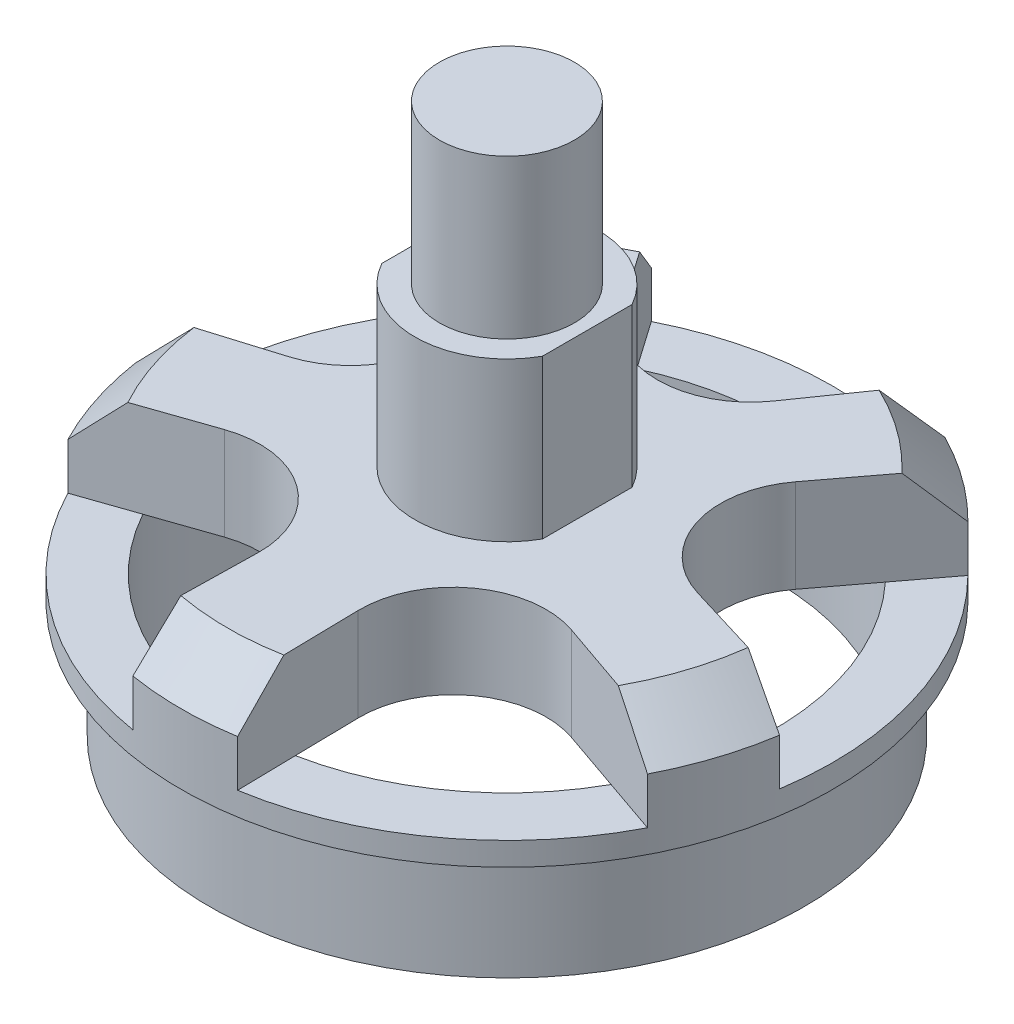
from build123d import *

# Parameters (mm, degrees)
SKETCH_1_R          = 14
EXTRUDE_1_DEPTH     = 10
SKETCH_2_R          = 11.5
CUT_EXTRUDE_1_DEPTH = 6
SKETCH_3_R          = 14
SKETCH_3_R_2        = 12.75
CUT_EXTRUDE_2_DEPTH = 5
CHAMFER_1_SIZE      = 2
EXTRUDE_2_DEPTH     = 6.8
SKETCH_6_R          = 2.9
EXTRUDE_3_DEPTH     = 6.8
SKETCH_7_R          = 1.5
CUT_EXTRUDE_4_DEPTH = 5
CUT_EXTRUDE_START   = -4
CUT_EXTRUDE_5_DEPTH = 4


with BuildPart() as part:
    # Sketch 1 → Extrude 1 (new body)
    with BuildSketch(Plane(origin=(0, 0, 0), x_dir=(1, 0, 0), z_dir=(0, 1, 0))):
        with Locations(Location((0, 0, 0), (0, 0, 270))):
            Circle(SKETCH_1_R)
    extrude(amount=EXTRUDE_1_DEPTH)

    # Sketch 2 → Cut-Extrude 1 (cut)
    with BuildSketch(Plane.XZ):
        with Locations(Location((0, 0, 0), (0, 0, 270))):
            Circle(SKETCH_2_R)
    extrude(amount=-CUT_EXTRUDE_1_DEPTH, mode=Mode.SUBTRACT)

    # Sketch 3 → Cut-Extrude 2 (cut)
    with BuildSketch(Plane.XZ):
        with Locations(Location((0, 0, 0), (0, 0, 270))):
            Circle(SKETCH_3_R)
        with Locations(Location((0, 0, 0), (0, 0, 270))):
            Circle(SKETCH_3_R_2, mode=Mode.SUBTRACT)
    extrude(amount=-CUT_EXTRUDE_2_DEPTH, mode=Mode.SUBTRACT)

    # Chamfer 1
    chamfer_1_edges = [part.edges().sort_by_distance(p)[0] for p in [
        (0, 10, -14),
    ]]
    chamfer(chamfer_1_edges, length=CHAMFER_1_SIZE)

    # Sketch 5 → Extrude 2 (add)
    with BuildSketch(Plane(origin=(0, 10, 0), x_dir=(1, 0, 0), z_dir=(0, 1, 0))):
        with BuildLine():
            Line((-3.45, 1.923538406), (-3.45, -1.923538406))
            ThreePointArc((-3.45, -1.923538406), (0, -3.95), (3.45, -1.923538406))
            Line((3.45, -1.923538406), (3.45, 1.923538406))
            ThreePointArc((3.45, 1.923538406), (0, 3.95), (-3.45, 1.923538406))
        make_face()
    extrude(amount=EXTRUDE_2_DEPTH)

    # Sketch 6 → Extrude 3 (add)
    with BuildSketch(Plane(origin=(0, 16.8, 0), x_dir=(1, 0, 0), z_dir=(0, 1, 0))):
        with Locations(Location((0, 0, 0), (0, 0, 270))):
            Circle(SKETCH_6_R)
    extrude(amount=EXTRUDE_3_DEPTH)

    # Sketch 7 → Cut-Extrude 4 (cut)
    with BuildSketch(Plane.XZ.offset(-6)):
        with Locations(Location((0, 0, 0), (0, 0, 270))):
            Circle(SKETCH_7_R)
    extrude(amount=-CUT_EXTRUDE_4_DEPTH, mode=Mode.SUBTRACT)

    # Sketch 4 → Cut-Extrude 5 (cut)
    with BuildSketch(Plane(origin=(0, 10, 0), x_dir=(1, 0, 0), z_dir=(0, 1, 0)).offset(CUT_EXTRUDE_START)):
        with BuildLine():
            ThreePointArc((14, 0), (12.945894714, 5.329522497), (9.942312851, 9.856491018))
            Line((9.942312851, 9.856491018), (6.758794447, 5.644884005))
            ThreePointArc((6.758794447, 5.644884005), (6.145521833, 1.996801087), (8.785959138, -0.594087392))
            Line((8.785959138, -0.594087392), (13.837000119, -2.130123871))
            ThreePointArc((13.837000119, -2.130123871), (13.959190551, -1.068175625), (14, 0))
        make_face()
        with BuildLine():
            Line((-6.301736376, 12.501524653), (-3.280021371, 8.17236059))
            ThreePointArc((-3.280021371, 8.17236059), (0, 6.461784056), (3.280021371, 8.17236059))
            Line((3.280021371, 8.17236059), (6.301736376, 12.501524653))
            ThreePointArc((6.301736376, 12.501524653), (0, 14), (-6.301736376, 12.501524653))
        make_face()
        with BuildLine():
            Line((-6.758794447, 5.644884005), (-9.942312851, 9.856491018))
            ThreePointArc((-9.942312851, 9.856491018), (-12.945894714, 5.329522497), (-14, 0))
            ThreePointArc((-14, 0), (-13.959190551, -1.068175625), (-13.837000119, -2.130123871))
            Line((-13.837000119, -2.130123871), (-8.785959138, -0.594087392))
            ThreePointArc((-8.785959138, -0.594087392), (-6.145521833, 1.996801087), (-6.758794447, 5.644884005))
        make_face()
        with BuildLine():
            Line((-7.457186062, -4.683630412), (-12.446423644, -6.409878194))
            ThreePointArc((-12.446423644, -6.409878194), (-8.228993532, -11.326237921), (-2.25, -13.818013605))
            Line((-2.25, -13.818013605), (-2.15, -8.53952679))
            ThreePointArc((-2.15, -8.53952679), (-3.798141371, -5.227693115), (-7.457186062, -4.683630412))
        make_face()
        with BuildLine():
            ThreePointArc((2.25, -13.818013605), (8.228993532, -11.326237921), (12.446423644, -6.409878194))
            Line((12.446423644, -6.409878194), (7.457186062, -4.683630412))
            ThreePointArc((7.457186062, -4.683630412), (3.798141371, -5.227693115), (2.15, -8.53952679))
            Line((2.15, -8.53952679), (2.25, -13.818013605))
        make_face()
    extrude(amount=CUT_EXTRUDE_5_DEPTH, mode=Mode.SUBTRACT)


solid = part.part
